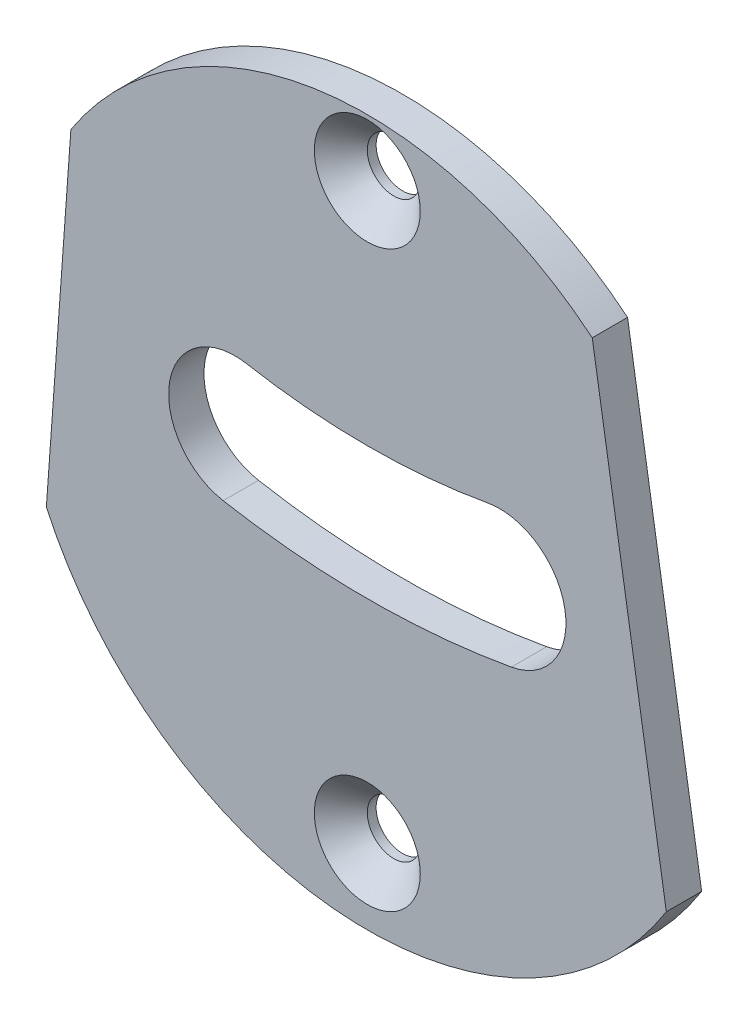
ISO-10303-21;
HEADER;
FILE_DESCRIPTION(('STEP AP214'),'2;1');
FILE_NAME('part.step','',(''),(''),'','','');
FILE_SCHEMA(('AUTOMOTIVE_DESIGN { 1 0 10303 214 1 1 1 1 }'));
ENDSEC;
DATA;
#1=APPLICATION_CONTEXT('core data for automotive mechanical design processes');
#2=APPLICATION_PROTOCOL_DEFINITION('international standard','automotive_design',2000,#1);
#3=PRODUCT_CONTEXT('',#1,'mechanical');
#4=PRODUCT('Part','Part','',(#3));
#5=PRODUCT_RELATED_PRODUCT_CATEGORY('part','',(#4));
#6=PRODUCT_DEFINITION_FORMATION('','',#4);
#7=PRODUCT_DEFINITION_CONTEXT('part definition',#1,'design');
#8=PRODUCT_DEFINITION('design','',#6,#7);
#9=PRODUCT_DEFINITION_SHAPE('','',#8);
#10=(LENGTH_UNIT() NAMED_UNIT(*) SI_UNIT(.MILLI.,.METRE.));
#11=(NAMED_UNIT(*) PLANE_ANGLE_UNIT() SI_UNIT($,.RADIAN.));
#12=(NAMED_UNIT(*) SI_UNIT($,.STERADIAN.) SOLID_ANGLE_UNIT());
#13=UNCERTAINTY_MEASURE_WITH_UNIT(LENGTH_MEASURE(1.E-05),#10,'distance_accuracy_value','');
#14=(GEOMETRIC_REPRESENTATION_CONTEXT(3) GLOBAL_UNCERTAINTY_ASSIGNED_CONTEXT((#13)) GLOBAL_UNIT_ASSIGNED_CONTEXT((#10,
#11,#12)) REPRESENTATION_CONTEXT('',''));
#15=CARTESIAN_POINT('',(0.,0.,0.));
#16=DIRECTION('',(0.,0.,1.));
#17=DIRECTION('',(1.,0.,0.));
#18=AXIS2_PLACEMENT_3D('',#15,#16,#17);
#19=CARTESIAN_POINT('',(1.00000000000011,-19.9999999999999,3.99999999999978));
#20=DIRECTION('',(0.,0.,1.));
#21=DIRECTION('',(1.,0.,0.));
#22=AXIS2_PLACEMENT_3D('',#19,#20,#21);
#23=PLANE('',#22);
#24=CARTESIAN_POINT('',(1.00000000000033,-51.5000000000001,4.00000000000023));
#25=DIRECTION('',(0.,0.,1.));
#26=DIRECTION('',(1.,0.,0.));
#27=AXIS2_PLACEMENT_3D('',#24,#25,#26);
#28=CIRCLE('',#27,6.);
#29=CARTESIAN_POINT('',(7.00000000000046,-51.4999999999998,4.00000000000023));
#30=VERTEX_POINT('',#29);
#31=EDGE_CURVE('E105',#30,#30,#28,.F.);
#32=ORIENTED_EDGE('',*,*,#31,.T.);
#33=EDGE_LOOP('',(#32));
#34=FACE_BOUND('',#33,.T.);
#35=CARTESIAN_POINT('',(1.00000000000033,13.5,4.));
#36=DIRECTION('',(0.,0.,1.));
#37=DIRECTION('',(1.,0.,0.));
#38=AXIS2_PLACEMENT_3D('',#35,#36,#37);
#39=CIRCLE('',#38,6.00000000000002);
#40=CARTESIAN_POINT('',(7.00000000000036,13.5,4.));
#41=VERTEX_POINT('',#40);
#42=EDGE_CURVE('E238',#41,#41,#39,.F.);
#43=ORIENTED_EDGE('',*,*,#42,.T.);
#44=EDGE_LOOP('',(#43));
#45=FACE_BOUND('',#44,.T.);
#46=CARTESIAN_POINT('',(1.00000000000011,-19.9999999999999,3.99999999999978));
#47=DIRECTION('',(0.,0.,1.));
#48=DIRECTION('',(1.,0.,0.));
#49=AXIS2_PLACEMENT_3D('',#46,#47,#48);
#50=CIRCLE('',#49,40.);
#51=CARTESIAN_POINT('',(26.4805357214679,10.8341093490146,4.));
#52=VERTEX_POINT('',#51);
#53=CARTESIAN_POINT('',(-32.5751113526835,1.74193868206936,4.00000000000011));
#54=VERTEX_POINT('',#53);
#55=EDGE_CURVE('E203',#52,#54,#50,.T.);
#56=ORIENTED_EDGE('',*,*,#55,.T.);
#57=DIRECTION('',(-0.0721361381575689,-0.997394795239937,0.));
#58=VECTOR('',#57,1.);
#59=CARTESIAN_POINT('',(-32.5751113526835,1.74193868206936,4.00000000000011));
#60=LINE('',#59,#58);
#61=CARTESIAN_POINT('',(-35.3542740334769,-36.6843267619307,4.));
#62=VERTEX_POINT('',#61);
#63=EDGE_CURVE('E206',#54,#62,#60,.T.);
#64=ORIENTED_EDGE('',*,*,#63,.T.);
#65=CARTESIAN_POINT('',(1.00000000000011,-19.9999999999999,3.99999999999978));
#66=DIRECTION('',(0.,0.,1.));
#67=DIRECTION('',(1.,0.,0.));
#68=AXIS2_PLACEMENT_3D('',#65,#66,#67);
#69=CIRCLE('',#68,40.);
#70=CARTESIAN_POINT('',(34.8716619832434,-41.2769949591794,3.99999999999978));
#71=VERTEX_POINT('',#70);
#72=EDGE_CURVE('E209',#62,#71,#69,.T.);
#73=ORIENTED_EDGE('',*,*,#72,.T.);
#74=DIRECTION('',(0.158975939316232,-0.987282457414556,0.));
#75=VECTOR('',#74,1.);
#76=CARTESIAN_POINT('',(26.4805357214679,10.8341093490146,4.));
#77=LINE('',#76,#75);
#78=EDGE_CURVE('E212',#52,#71,#77,.T.);
#79=ORIENTED_EDGE('',*,*,#78,.F.);
#80=EDGE_LOOP('',(#56,#64,#73,#79));
#81=FACE_BOUND('',#80,.T.);
#82=CARTESIAN_POINT('',(1.00000000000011,65.,4.));
#83=DIRECTION('',(0.,0.,1.));
#84=DIRECTION('',(1.,0.,0.));
#85=AXIS2_PLACEMENT_3D('',#82,#83,#84);
#86=CIRCLE('',#85,92.5);
#87=CARTESIAN_POINT('',(-15.3235294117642,-26.0482970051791,4.00000000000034));
#88=VERTEX_POINT('',#87);
#89=CARTESIAN_POINT('',(17.3235294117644,-26.0482970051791,3.99999999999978));
#90=VERTEX_POINT('',#89);
#91=EDGE_CURVE('E170',#88,#90,#86,.T.);
#92=ORIENTED_EDGE('',*,*,#91,.F.);
#93=CARTESIAN_POINT('',(-13.9999999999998,-18.6660026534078,4.00000000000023));
#94=DIRECTION('',(0.,0.,1.));
#95=DIRECTION('',(1.,0.,0.));
#96=AXIS2_PLACEMENT_3D('',#93,#94,#95);
#97=CIRCLE('',#96,7.50000000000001);
#98=CARTESIAN_POINT('',(-12.6764705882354,-11.2837083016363,3.99999999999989));
#99=VERTEX_POINT('',#98);
#100=EDGE_CURVE('E162',#99,#88,#97,.T.);
#101=ORIENTED_EDGE('',*,*,#100,.F.);
#102=CARTESIAN_POINT('',(1.00000000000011,65.,4.));
#103=DIRECTION('',(0.,0.,1.));
#104=DIRECTION('',(1.,0.,0.));
#105=AXIS2_PLACEMENT_3D('',#102,#103,#104);
#106=CIRCLE('',#105,77.5);
#107=CARTESIAN_POINT('',(14.6764705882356,-11.2837083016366,4.));
#108=VERTEX_POINT('',#107);
#109=EDGE_CURVE('E184',#99,#108,#106,.T.);
#110=ORIENTED_EDGE('',*,*,#109,.T.);
#111=CARTESIAN_POINT('',(16.0000000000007,-18.6660026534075,4.00000000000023));
#112=DIRECTION('',(0.,0.,1.));
#113=DIRECTION('',(1.,0.,0.));
#114=AXIS2_PLACEMENT_3D('',#111,#112,#113);
#115=CIRCLE('',#114,7.5);
#116=EDGE_CURVE('E182',#90,#108,#115,.T.);
#117=ORIENTED_EDGE('',*,*,#116,.F.);
#118=EDGE_LOOP('',(#92,#101,#110,#117));
#119=FACE_BOUND('',#118,.T.);
#120=ADVANCED_FACE('F97',(#34,#45,#81,#119),#23,.T.);
#121=CARTESIAN_POINT('',(1.00000000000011,-19.9999999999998,-2.22044604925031E-13));
#122=DIRECTION('',(0.,0.,1.));
#123=DIRECTION('',(1.,0.,0.));
#124=AXIS2_PLACEMENT_3D('',#121,#122,#123);
#125=PLANE('',#124);
#126=CARTESIAN_POINT('',(1.00000000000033,-51.5000000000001,2.22044604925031E-13));
#127=DIRECTION('',(0.,0.,1.));
#128=DIRECTION('',(1.,0.,0.));
#129=AXIS2_PLACEMENT_3D('',#126,#127,#128);
#130=CIRCLE('',#129,3.);
#131=CARTESIAN_POINT('',(4.00000000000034,-51.5000000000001,2.21711538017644E-13));
#132=VERTEX_POINT('',#131);
#133=EDGE_CURVE('E178',#132,#132,#130,.T.);
#134=ORIENTED_EDGE('',*,*,#133,.T.);
#135=EDGE_LOOP('',(#134));
#136=FACE_BOUND('',#135,.T.);
#137=CARTESIAN_POINT('',(1.00000000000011,-19.9999999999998,-2.22044604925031E-13));
#138=DIRECTION('',(0.,0.,1.));
#139=DIRECTION('',(1.,0.,0.));
#140=AXIS2_PLACEMENT_3D('',#137,#138,#139);
#141=CIRCLE('',#140,40.);
#142=CARTESIAN_POINT('',(26.4805357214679,10.8341093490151,-2.22044604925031E-13));
#143=VERTEX_POINT('',#142);
#144=CARTESIAN_POINT('',(-32.5751113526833,1.74193868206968,0.));
#145=VERTEX_POINT('',#144);
#146=EDGE_CURVE('E202',#143,#145,#141,.T.);
#147=ORIENTED_EDGE('',*,*,#146,.F.);
#148=DIRECTION('',(0.158975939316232,-0.987282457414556,0.));
#149=VECTOR('',#148,1.);
#150=CARTESIAN_POINT('',(26.4805357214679,10.8341093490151,-2.22044604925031E-13));
#151=LINE('',#150,#149);
#152=CARTESIAN_POINT('',(34.8716619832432,-41.2769949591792,0.));
#153=VERTEX_POINT('',#152);
#154=EDGE_CURVE('E207',#143,#153,#151,.T.);
#155=ORIENTED_EDGE('',*,*,#154,.T.);
#156=CARTESIAN_POINT('',(1.00000000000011,-19.9999999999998,-2.22044604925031E-13));
#157=DIRECTION('',(0.,0.,1.));
#158=DIRECTION('',(1.,0.,0.));
#159=AXIS2_PLACEMENT_3D('',#156,#157,#158);
#160=CIRCLE('',#159,40.);
#161=CARTESIAN_POINT('',(-35.3542740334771,-36.6843267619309,0.));
#162=VERTEX_POINT('',#161);
#163=EDGE_CURVE('E221',#162,#153,#160,.T.);
#164=ORIENTED_EDGE('',*,*,#163,.F.);
#165=DIRECTION('',(-0.0721361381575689,-0.997394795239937,0.));
#166=VECTOR('',#165,1.);
#167=CARTESIAN_POINT('',(-32.5751113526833,1.74193868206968,0.));
#168=LINE('',#167,#166);
#169=EDGE_CURVE('E219',#145,#162,#168,.T.);
#170=ORIENTED_EDGE('',*,*,#169,.F.);
#171=EDGE_LOOP('',(#147,#155,#164,#170));
#172=FACE_BOUND('',#171,.T.);
#173=CARTESIAN_POINT('',(1.00000000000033,13.4999999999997,0.));
#174=DIRECTION('',(0.,0.,1.));
#175=DIRECTION('',(1.,0.,0.));
#176=AXIS2_PLACEMENT_3D('',#173,#174,#175);
#177=CIRCLE('',#176,3.);
#178=CARTESIAN_POINT('',(4.00000000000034,13.4999999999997,0.));
#179=VERTEX_POINT('',#178);
#180=EDGE_CURVE('E199',#179,#179,#177,.T.);
#181=ORIENTED_EDGE('',*,*,#180,.T.);
#182=EDGE_LOOP('',(#181));
#183=FACE_BOUND('',#182,.T.);
#184=CARTESIAN_POINT('',(-13.9999999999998,-18.6660026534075,0.));
#185=DIRECTION('',(0.,0.,1.));
#186=DIRECTION('',(1.,0.,0.));
#187=AXIS2_PLACEMENT_3D('',#184,#185,#186);
#188=CIRCLE('',#187,7.50000000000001);
#189=CARTESIAN_POINT('',(-12.6764705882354,-11.2837083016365,-1.11022302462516E-13));
#190=VERTEX_POINT('',#189);
#191=CARTESIAN_POINT('',(-15.3235294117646,-26.0482970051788,3.33066907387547E-13));
#192=VERTEX_POINT('',#191);
#193=EDGE_CURVE('E120',#190,#192,#188,.T.);
#194=ORIENTED_EDGE('',*,*,#193,.T.);
#195=CARTESIAN_POINT('',(0.99999999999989,65.,0.));
#196=DIRECTION('',(0.,0.,1.));
#197=DIRECTION('',(1.,0.,0.));
#198=AXIS2_PLACEMENT_3D('',#195,#196,#197);
#199=CIRCLE('',#198,92.5);
#200=CARTESIAN_POINT('',(17.3235294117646,-26.0482970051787,-1.11022302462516E-13));
#201=VERTEX_POINT('',#200);
#202=EDGE_CURVE('E177',#192,#201,#199,.T.);
#203=ORIENTED_EDGE('',*,*,#202,.T.);
#204=CARTESIAN_POINT('',(16.0000000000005,-18.6660026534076,0.));
#205=DIRECTION('',(0.,0.,1.));
#206=DIRECTION('',(1.,0.,0.));
#207=AXIS2_PLACEMENT_3D('',#204,#205,#206);
#208=CIRCLE('',#207,7.5);
#209=CARTESIAN_POINT('',(14.6764705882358,-11.2837083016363,-2.22044604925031E-13));
#210=VERTEX_POINT('',#209);
#211=EDGE_CURVE('E190',#201,#210,#208,.T.);
#212=ORIENTED_EDGE('',*,*,#211,.T.);
#213=CARTESIAN_POINT('',(0.99999999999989,65.,0.));
#214=DIRECTION('',(0.,0.,1.));
#215=DIRECTION('',(1.,0.,0.));
#216=AXIS2_PLACEMENT_3D('',#213,#214,#215);
#217=CIRCLE('',#216,77.5);
#218=EDGE_CURVE('E171',#190,#210,#217,.T.);
#219=ORIENTED_EDGE('',*,*,#218,.F.);
#220=EDGE_LOOP('',(#194,#203,#212,#219));
#221=FACE_BOUND('',#220,.T.);
#222=ADVANCED_FACE('F258',(#136,#172,#183,#221),#125,.F.);
#223=CARTESIAN_POINT('',(1.00000000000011,-19.9999999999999,3.99999999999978));
#224=DIRECTION('',(0.,0.,-1.));
#225=DIRECTION('',(-1.,0.,0.));
#226=AXIS2_PLACEMENT_3D('',#223,#224,#225);
#227=CYLINDRICAL_SURFACE('',#226,40.);
#228=ORIENTED_EDGE('',*,*,#146,.T.);
#229=DIRECTION('',(0.,0.,-1.));
#230=VECTOR('',#229,1.);
#231=CARTESIAN_POINT('',(-32.5751113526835,1.74193868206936,4.00000000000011));
#232=LINE('',#231,#230);
#233=EDGE_CURVE('E232',#54,#145,#232,.T.);
#234=ORIENTED_EDGE('',*,*,#233,.F.);
#235=ORIENTED_EDGE('',*,*,#55,.F.);
#236=DIRECTION('',(0.,0.,-1.));
#237=VECTOR('',#236,1.);
#238=CARTESIAN_POINT('',(26.4805357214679,10.8341093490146,4.));
#239=LINE('',#238,#237);
#240=EDGE_CURVE('E216',#52,#143,#239,.T.);
#241=ORIENTED_EDGE('',*,*,#240,.T.);
#242=EDGE_LOOP('',(#228,#234,#235,#241));
#243=FACE_BOUND('',#242,.T.);
#244=ADVANCED_FACE('F261',(#243),#227,.T.);
#245=CARTESIAN_POINT('',(-32.5751113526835,1.74193868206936,4.00000000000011));
#246=DIRECTION('',(0.997394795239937,-0.072136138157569,0.));
#247=DIRECTION('',(0.0721361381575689,0.997394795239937,0.));
#248=AXIS2_PLACEMENT_3D('',#245,#246,#247);
#249=PLANE('',#248);
#250=ORIENTED_EDGE('',*,*,#169,.T.);
#251=DIRECTION('',(0.,0.,-1.));
#252=VECTOR('',#251,1.);
#253=CARTESIAN_POINT('',(-35.3542740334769,-36.6843267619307,4.));
#254=LINE('',#253,#252);
#255=EDGE_CURVE('E229',#62,#162,#254,.T.);
#256=ORIENTED_EDGE('',*,*,#255,.F.);
#257=ORIENTED_EDGE('',*,*,#63,.F.);
#258=ORIENTED_EDGE('',*,*,#233,.T.);
#259=EDGE_LOOP('',(#250,#256,#257,#258));
#260=FACE_BOUND('',#259,.T.);
#261=ADVANCED_FACE('F291',(#260),#249,.F.);
#262=CARTESIAN_POINT('',(1.00000000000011,-19.9999999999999,3.99999999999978));
#263=DIRECTION('',(0.,0.,-1.));
#264=DIRECTION('',(-1.,0.,0.));
#265=AXIS2_PLACEMENT_3D('',#262,#263,#264);
#266=CYLINDRICAL_SURFACE('',#265,40.);
#267=ORIENTED_EDGE('',*,*,#163,.T.);
#268=DIRECTION('',(0.,0.,-1.));
#269=VECTOR('',#268,1.);
#270=CARTESIAN_POINT('',(34.8716619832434,-41.2769949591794,3.99999999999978));
#271=LINE('',#270,#269);
#272=EDGE_CURVE('E227',#71,#153,#271,.T.);
#273=ORIENTED_EDGE('',*,*,#272,.F.);
#274=ORIENTED_EDGE('',*,*,#72,.F.);
#275=ORIENTED_EDGE('',*,*,#255,.T.);
#276=EDGE_LOOP('',(#267,#273,#274,#275));
#277=FACE_BOUND('',#276,.T.);
#278=ADVANCED_FACE('F287',(#277),#266,.T.);
#279=CARTESIAN_POINT('',(26.4805357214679,10.8341093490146,4.));
#280=DIRECTION('',(0.987282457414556,0.158975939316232,0.));
#281=DIRECTION('',(-0.158975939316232,0.987282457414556,0.));
#282=AXIS2_PLACEMENT_3D('',#279,#280,#281);
#283=PLANE('',#282);
#284=ORIENTED_EDGE('',*,*,#154,.F.);
#285=ORIENTED_EDGE('',*,*,#240,.F.);
#286=ORIENTED_EDGE('',*,*,#78,.T.);
#287=ORIENTED_EDGE('',*,*,#272,.T.);
#288=EDGE_LOOP('',(#284,#285,#286,#287));
#289=FACE_BOUND('',#288,.T.);
#290=ADVANCED_FACE('F284',(#289),#283,.T.);
#291=CARTESIAN_POINT('',(1.00000000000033,13.5,4.));
#292=DIRECTION('',(0.,0.,-1.));
#293=DIRECTION('',(-1.,0.,0.));
#294=AXIS2_PLACEMENT_3D('',#291,#292,#293);
#295=CYLINDRICAL_SURFACE('',#294,3.);
#296=CARTESIAN_POINT('',(1.00000000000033,13.5,1.00000000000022));
#297=DIRECTION('',(0.,0.,1.));
#298=DIRECTION('',(1.,0.,0.));
#299=AXIS2_PLACEMENT_3D('',#296,#297,#298);
#300=CIRCLE('',#299,3.);
#301=CARTESIAN_POINT('',(4.00000000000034,13.5,1.00000000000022));
#302=VERTEX_POINT('',#301);
#303=EDGE_CURVE('E14',#302,#302,#300,.T.);
#304=ORIENTED_EDGE('',*,*,#303,.T.);
#305=EDGE_LOOP('',(#304));
#306=FACE_BOUND('',#305,.T.);
#307=ORIENTED_EDGE('',*,*,#180,.F.);
#308=EDGE_LOOP('',(#307));
#309=FACE_BOUND('',#308,.T.);
#310=ADVANCED_FACE('F254',(#306,#309),#295,.F.);
#311=CARTESIAN_POINT('',(1.00000000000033,-51.5000000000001,4.00000000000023));
#312=DIRECTION('',(0.,0.,-1.));
#313=DIRECTION('',(-1.,0.,0.));
#314=AXIS2_PLACEMENT_3D('',#311,#312,#313);
#315=CYLINDRICAL_SURFACE('',#314,3.);
#316=CARTESIAN_POINT('',(1.00000000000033,-51.4999999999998,1.00000000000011));
#317=DIRECTION('',(0.,0.,1.));
#318=DIRECTION('',(1.,0.,0.));
#319=AXIS2_PLACEMENT_3D('',#316,#317,#318);
#320=CIRCLE('',#319,3.);
#321=CARTESIAN_POINT('',(4.00000000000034,-51.4999999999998,1.00000000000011));
#322=VERTEX_POINT('',#321);
#323=EDGE_CURVE('E235',#322,#322,#320,.T.);
#324=ORIENTED_EDGE('',*,*,#323,.T.);
#325=EDGE_LOOP('',(#324));
#326=FACE_BOUND('',#325,.T.);
#327=ORIENTED_EDGE('',*,*,#133,.F.);
#328=EDGE_LOOP('',(#327));
#329=FACE_BOUND('',#328,.T.);
#330=ADVANCED_FACE('F251',(#326,#329),#315,.F.);
#331=CARTESIAN_POINT('',(-13.9999999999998,-18.6660026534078,4.00000000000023));
#332=DIRECTION('',(0.,0.,-1.));
#333=DIRECTION('',(-1.,0.,0.));
#334=AXIS2_PLACEMENT_3D('',#331,#332,#333);
#335=CYLINDRICAL_SURFACE('',#334,7.50000000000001);
#336=ORIENTED_EDGE('',*,*,#193,.F.);
#337=DIRECTION('',(0.,0.,-1.));
#338=VECTOR('',#337,1.);
#339=CARTESIAN_POINT('',(-12.6764705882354,-11.2837083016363,3.99999999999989));
#340=LINE('',#339,#338);
#341=EDGE_CURVE('E166',#99,#190,#340,.T.);
#342=ORIENTED_EDGE('',*,*,#341,.F.);
#343=ORIENTED_EDGE('',*,*,#100,.T.);
#344=DIRECTION('',(0.,0.,-1.));
#345=VECTOR('',#344,1.);
#346=CARTESIAN_POINT('',(-15.3235294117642,-26.0482970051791,4.00000000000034));
#347=LINE('',#346,#345);
#348=EDGE_CURVE('E165',#88,#192,#347,.T.);
#349=ORIENTED_EDGE('',*,*,#348,.T.);
#350=EDGE_LOOP('',(#336,#342,#343,#349));
#351=FACE_BOUND('',#350,.T.);
#352=ADVANCED_FACE('F164',(#351),#335,.F.);
#353=CARTESIAN_POINT('',(1.00000000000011,65.,4.));
#354=DIRECTION('',(0.,0.,-1.));
#355=DIRECTION('',(-1.,0.,0.));
#356=AXIS2_PLACEMENT_3D('',#353,#354,#355);
#357=CYLINDRICAL_SURFACE('',#356,92.5);
#358=ORIENTED_EDGE('',*,*,#202,.F.);
#359=ORIENTED_EDGE('',*,*,#348,.F.);
#360=ORIENTED_EDGE('',*,*,#91,.T.);
#361=DIRECTION('',(0.,0.,-1.));
#362=VECTOR('',#361,1.);
#363=CARTESIAN_POINT('',(17.3235294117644,-26.0482970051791,3.99999999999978));
#364=LINE('',#363,#362);
#365=EDGE_CURVE('E179',#90,#201,#364,.T.);
#366=ORIENTED_EDGE('',*,*,#365,.T.);
#367=EDGE_LOOP('',(#358,#359,#360,#366));
#368=FACE_BOUND('',#367,.T.);
#369=ADVANCED_FACE('F174',(#368),#357,.F.);
#370=CARTESIAN_POINT('',(16.0000000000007,-18.6660026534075,4.00000000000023));
#371=DIRECTION('',(0.,0.,-1.));
#372=DIRECTION('',(-1.,0.,0.));
#373=AXIS2_PLACEMENT_3D('',#370,#371,#372);
#374=CYLINDRICAL_SURFACE('',#373,7.5);
#375=ORIENTED_EDGE('',*,*,#211,.F.);
#376=ORIENTED_EDGE('',*,*,#365,.F.);
#377=ORIENTED_EDGE('',*,*,#116,.T.);
#378=DIRECTION('',(0.,0.,-1.));
#379=VECTOR('',#378,1.);
#380=CARTESIAN_POINT('',(14.6764705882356,-11.2837083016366,4.));
#381=LINE('',#380,#379);
#382=EDGE_CURVE('E112',#108,#210,#381,.T.);
#383=ORIENTED_EDGE('',*,*,#382,.T.);
#384=EDGE_LOOP('',(#375,#376,#377,#383));
#385=FACE_BOUND('',#384,.T.);
#386=ADVANCED_FACE('F271',(#385),#374,.F.);
#387=CARTESIAN_POINT('',(1.00000000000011,65.,4.));
#388=DIRECTION('',(0.,0.,-1.));
#389=DIRECTION('',(-1.,0.,0.));
#390=AXIS2_PLACEMENT_3D('',#387,#388,#389);
#391=CYLINDRICAL_SURFACE('',#390,77.5);
#392=ORIENTED_EDGE('',*,*,#218,.T.);
#393=ORIENTED_EDGE('',*,*,#382,.F.);
#394=ORIENTED_EDGE('',*,*,#109,.F.);
#395=ORIENTED_EDGE('',*,*,#341,.T.);
#396=EDGE_LOOP('',(#392,#393,#394,#395));
#397=FACE_BOUND('',#396,.T.);
#398=ADVANCED_FACE('F248',(#397),#391,.T.);
#399=CARTESIAN_POINT('',(1.00000000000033,-51.4999999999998,1.00000000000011));
#400=DIRECTION('',(0.,0.,1.));
#401=DIRECTION('',(1.,0.,0.));
#402=AXIS2_PLACEMENT_3D('',#399,#400,#401);
#403=CONICAL_SURFACE('',#402,3.,0.785398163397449);
#404=CARTESIAN_POINT('',(7.00000000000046,-51.4999999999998,4.00000000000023));
#405=CARTESIAN_POINT('',(6.96875000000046,-51.4999999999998,3.96875000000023));
#406=CARTESIAN_POINT('',(6.93750000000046,-51.4999999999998,3.93750000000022));
#407=CARTESIAN_POINT('',(6.87500000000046,-51.4999999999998,3.87500000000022));
#408=CARTESIAN_POINT('',(6.84375000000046,-51.4999999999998,3.84375000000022));
#409=CARTESIAN_POINT('',(6.78125000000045,-51.4999999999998,3.78125000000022));
#410=CARTESIAN_POINT('',(6.75000000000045,-51.4999999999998,3.75000000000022));
#411=CARTESIAN_POINT('',(6.68750000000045,-51.4999999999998,3.68750000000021));
#412=CARTESIAN_POINT('',(6.65625000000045,-51.4999999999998,3.65625000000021));
#413=CARTESIAN_POINT('',(6.59375000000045,-51.4999999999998,3.59375000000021));
#414=CARTESIAN_POINT('',(6.56250000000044,-51.4999999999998,3.56250000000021));
#415=CARTESIAN_POINT('',(6.50000000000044,-51.4999999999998,3.50000000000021));
#416=CARTESIAN_POINT('',(6.46875000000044,-51.4999999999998,3.46875000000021));
#417=CARTESIAN_POINT('',(6.40625000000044,-51.4999999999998,3.4062500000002));
#418=CARTESIAN_POINT('',(6.37500000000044,-51.4999999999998,3.3750000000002));
#419=CARTESIAN_POINT('',(6.31250000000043,-51.4999999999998,3.3125000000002));
#420=CARTESIAN_POINT('',(6.28125000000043,-51.4999999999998,3.2812500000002));
#421=CARTESIAN_POINT('',(6.21875000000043,-51.4999999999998,3.2187500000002));
#422=CARTESIAN_POINT('',(6.18750000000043,-51.4999999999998,3.18750000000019));
#423=CARTESIAN_POINT('',(6.12500000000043,-51.4999999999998,3.12500000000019));
#424=CARTESIAN_POINT('',(6.09375000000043,-51.4999999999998,3.09375000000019));
#425=CARTESIAN_POINT('',(6.03125000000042,-51.4999999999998,3.03125000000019));
#426=CARTESIAN_POINT('',(6.00000000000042,-51.4999999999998,3.00000000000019));
#427=CARTESIAN_POINT('',(5.93750000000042,-51.4999999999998,2.93750000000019));
#428=CARTESIAN_POINT('',(5.90625000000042,-51.4999999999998,2.90625000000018));
#429=CARTESIAN_POINT('',(5.84375000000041,-51.4999999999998,2.84375000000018));
#430=CARTESIAN_POINT('',(5.81250000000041,-51.4999999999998,2.81250000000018));
#431=CARTESIAN_POINT('',(5.75000000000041,-51.4999999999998,2.75000000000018));
#432=CARTESIAN_POINT('',(5.71875000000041,-51.4999999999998,2.71875000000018));
#433=CARTESIAN_POINT('',(5.65625000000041,-51.4999999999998,2.65625000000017));
#434=CARTESIAN_POINT('',(5.62500000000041,-51.4999999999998,2.62500000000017));
#435=CARTESIAN_POINT('',(5.5625000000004,-51.4999999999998,2.56250000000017));
#436=CARTESIAN_POINT('',(5.5312500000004,-51.4999999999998,2.53125000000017));
#437=CARTESIAN_POINT('',(5.4687500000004,-51.4999999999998,2.46875000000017));
#438=CARTESIAN_POINT('',(5.4375000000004,-51.4999999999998,2.43750000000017));
#439=CARTESIAN_POINT('',(5.3750000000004,-51.4999999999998,2.37500000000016));
#440=CARTESIAN_POINT('',(5.3437500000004,-51.4999999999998,2.34375000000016));
#441=CARTESIAN_POINT('',(5.28125000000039,-51.4999999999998,2.28125000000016));
#442=CARTESIAN_POINT('',(5.25000000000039,-51.4999999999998,2.25000000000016));
#443=CARTESIAN_POINT('',(5.18750000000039,-51.4999999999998,2.18750000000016));
#444=CARTESIAN_POINT('',(5.15625000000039,-51.4999999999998,2.15625000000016));
#445=CARTESIAN_POINT('',(5.09375000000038,-51.4999999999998,2.09375000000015));
#446=CARTESIAN_POINT('',(5.06250000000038,-51.4999999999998,2.06250000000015));
#447=CARTESIAN_POINT('',(5.00000000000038,-51.4999999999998,2.00000000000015));
#448=CARTESIAN_POINT('',(4.96875000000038,-51.4999999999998,1.96875000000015));
#449=CARTESIAN_POINT('',(4.90625000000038,-51.4999999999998,1.90625000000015));
#450=CARTESIAN_POINT('',(4.87500000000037,-51.4999999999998,1.87500000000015));
#451=CARTESIAN_POINT('',(4.81250000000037,-51.4999999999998,1.81250000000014));
#452=CARTESIAN_POINT('',(4.78125000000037,-51.4999999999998,1.78125000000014));
#453=CARTESIAN_POINT('',(4.71875000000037,-51.4999999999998,1.71875000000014));
#454=CARTESIAN_POINT('',(4.68750000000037,-51.4999999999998,1.68750000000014));
#455=CARTESIAN_POINT('',(4.62500000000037,-51.4999999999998,1.62500000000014));
#456=CARTESIAN_POINT('',(4.59375000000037,-51.4999999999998,1.59375000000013));
#457=CARTESIAN_POINT('',(4.53125000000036,-51.4999999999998,1.53125000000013));
#458=CARTESIAN_POINT('',(4.50000000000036,-51.4999999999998,1.50000000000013));
#459=CARTESIAN_POINT('',(4.43750000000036,-51.4999999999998,1.43750000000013));
#460=CARTESIAN_POINT('',(4.40625000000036,-51.4999999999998,1.40625000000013));
#461=CARTESIAN_POINT('',(4.34375000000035,-51.4999999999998,1.34375000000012));
#462=CARTESIAN_POINT('',(4.31250000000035,-51.4999999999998,1.31250000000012));
#463=CARTESIAN_POINT('',(4.25000000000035,-51.4999999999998,1.25000000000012));
#464=CARTESIAN_POINT('',(4.21875000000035,-51.4999999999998,1.21875000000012));
#465=CARTESIAN_POINT('',(4.15625000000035,-51.4999999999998,1.15625000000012));
#466=CARTESIAN_POINT('',(4.12500000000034,-51.4999999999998,1.12500000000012));
#467=CARTESIAN_POINT('',(4.06250000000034,-51.4999999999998,1.06250000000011));
#468=CARTESIAN_POINT('',(4.03125000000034,-51.4999999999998,1.03125000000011));
#469=CARTESIAN_POINT('',(4.00000000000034,-51.4999999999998,1.00000000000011));
#470=B_SPLINE_CURVE_WITH_KNOTS('',3,(#404,#405,#406,#407,#408,#409,#410,#411,#412,#413,#414,
#415,#416,#417,#418,#419,#420,#421,#422,#423,#424,#425,#426,#427,#428,#429,#430,#431,#432,#433,
#434,#435,#436,#437,#438,#439,#440,#441,#442,#443,#444,#445,#446,#447,#448,#449,#450,#451,#452,
#453,#454,#455,#456,#457,#458,#459,#460,#461,#462,#463,#464,#465,#466,#467,#468,#469),
.UNSPECIFIED.,.F.,.F.,(4,2,2,2,2,2,2,2,2,2,2,2,2,2,2,2,2,2,2,2,2,2,2,2,2,2,2,2,2,2,2,2,4),(0.,
0.132582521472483,0.265165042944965,0.397747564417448,0.530330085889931,0.662912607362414,
0.795495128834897,0.928077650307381,1.06066017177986,1.19324269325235,1.32582521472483,
1.45840773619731,1.59099025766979,1.72357277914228,1.85615530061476,1.98873782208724,
2.12132034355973,2.25390286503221,2.38648538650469,2.51906790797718,2.65165042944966,
2.78423295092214,2.91681547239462,3.04939799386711,3.18198051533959,3.31456303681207,
3.44714555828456,3.57972807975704,3.71231060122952,3.844893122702,3.97747564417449,
4.11005816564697,4.24264068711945),.UNSPECIFIED.);
#471=EDGE_CURVE('BSEAM245',#30,#322,#470,.T.);
#472=ORIENTED_EDGE('',*,*,#31,.F.);
#473=ORIENTED_EDGE('',*,*,#323,.F.);
#474=ORIENTED_EDGE('',*,*,#471,.T.);
#475=ORIENTED_EDGE('',*,*,#471,.F.);
#476=EDGE_LOOP('',(#472,#474,#473,#475));
#477=FACE_BOUND('',#476,.T.);
#478=ADVANCED_FACE('F245',(#477),#403,.F.);
#479=CARTESIAN_POINT('',(1.00000000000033,13.5,1.00000000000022));
#480=DIRECTION('',(0.,0.,1.));
#481=DIRECTION('',(1.,0.,0.));
#482=AXIS2_PLACEMENT_3D('',#479,#480,#481);
#483=CONICAL_SURFACE('',#482,3.,0.785398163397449);
#484=ORIENTED_EDGE('',*,*,#42,.F.);
#485=EDGE_LOOP('',(#484));
#486=FACE_BOUND('',#485,.T.);
#487=ORIENTED_EDGE('',*,*,#303,.F.);
#488=EDGE_LOOP('',(#487));
#489=FACE_BOUND('',#488,.T.);
#490=ADVANCED_FACE('F99',(#486,#489),#483,.F.);
#491=CLOSED_SHELL('',(#120,#222,#244,#261,#278,#290,#310,#330,#352,#369,#386,#398,#478,#490));
#492=MANIFOLD_SOLID_BREP('B2',#491);
#493=ADVANCED_BREP_SHAPE_REPRESENTATION('',(#18,#492),#14);
#494=SHAPE_DEFINITION_REPRESENTATION(#9,#493);
ENDSEC;
END-ISO-10303-21;
